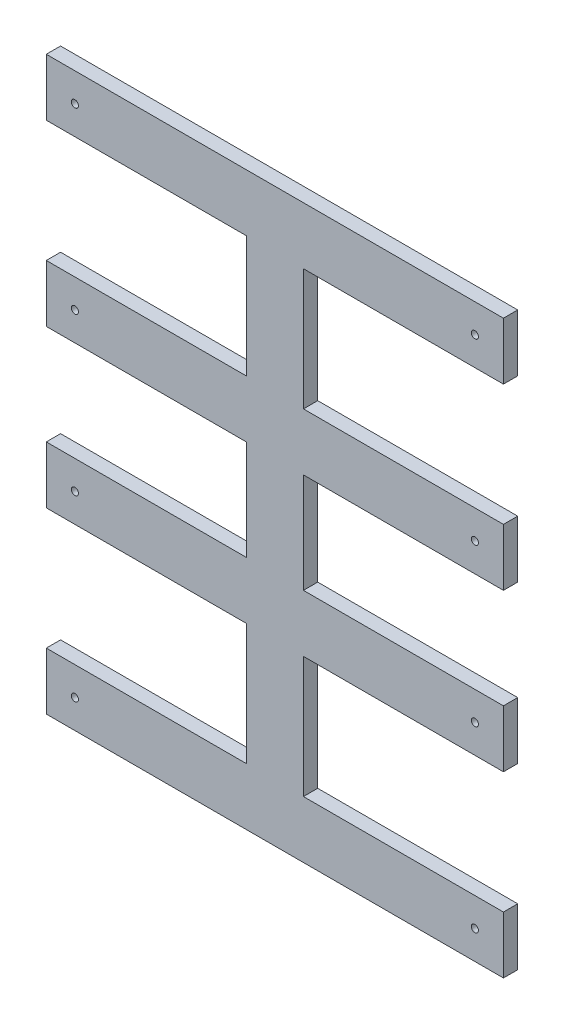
ISO-10303-21;
HEADER;
FILE_DESCRIPTION(('STEP AP214'),'2;1');
FILE_NAME('part.step','',(''),(''),'','','');
FILE_SCHEMA(('AUTOMOTIVE_DESIGN { 1 0 10303 214 1 1 1 1 }'));
ENDSEC;
DATA;
#1=APPLICATION_CONTEXT('core data for automotive mechanical design processes');
#2=APPLICATION_PROTOCOL_DEFINITION('international standard','automotive_design',2000,#1);
#3=PRODUCT_CONTEXT('',#1,'mechanical');
#4=PRODUCT('Part','Part','',(#3));
#5=PRODUCT_RELATED_PRODUCT_CATEGORY('part','',(#4));
#6=PRODUCT_DEFINITION_FORMATION('','',#4);
#7=PRODUCT_DEFINITION_CONTEXT('part definition',#1,'design');
#8=PRODUCT_DEFINITION('design','',#6,#7);
#9=PRODUCT_DEFINITION_SHAPE('','',#8);
#10=(LENGTH_UNIT() NAMED_UNIT(*) SI_UNIT(.MILLI.,.METRE.));
#11=(NAMED_UNIT(*) PLANE_ANGLE_UNIT() SI_UNIT($,.RADIAN.));
#12=(NAMED_UNIT(*) SI_UNIT($,.STERADIAN.) SOLID_ANGLE_UNIT());
#13=UNCERTAINTY_MEASURE_WITH_UNIT(LENGTH_MEASURE(1.E-05),#10,'distance_accuracy_value','');
#14=(GEOMETRIC_REPRESENTATION_CONTEXT(3) GLOBAL_UNCERTAINTY_ASSIGNED_CONTEXT((#13)) GLOBAL_UNIT_ASSIGNED_CONTEXT((#10,
#11,#12)) REPRESENTATION_CONTEXT('',''));
#15=CARTESIAN_POINT('',(0.,0.,0.));
#16=DIRECTION('',(0.,0.,1.));
#17=DIRECTION('',(1.,0.,0.));
#18=AXIS2_PLACEMENT_3D('',#15,#16,#17);
#19=CARTESIAN_POINT('',(0.,0.,6.35));
#20=DIRECTION('',(0.,0.,1.));
#21=DIRECTION('',(1.,0.,0.));
#22=AXIS2_PLACEMENT_3D('',#19,#20,#21);
#23=PLANE('',#22);
#24=CARTESIAN_POINT('',(88.9,-114.3,6.35));
#25=DIRECTION('',(0.,0.,1.));
#26=DIRECTION('',(-1.,0.,0.));
#27=AXIS2_PLACEMENT_3D('',#24,#25,#26);
#28=CIRCLE('',#27,1.5875);
#29=CARTESIAN_POINT('',(87.3125,-114.3,6.35));
#30=VERTEX_POINT('',#29);
#31=EDGE_CURVE('E516',#30,#30,#28,.T.);
#32=ORIENTED_EDGE('',*,*,#31,.F.);
#33=EDGE_LOOP('',(#32));
#34=FACE_BOUND('',#33,.T.);
#35=CARTESIAN_POINT('',(-88.9,-34.925,6.35));
#36=DIRECTION('',(0.,0.,1.));
#37=DIRECTION('',(-1.,0.,0.));
#38=AXIS2_PLACEMENT_3D('',#35,#36,#37);
#39=CIRCLE('',#38,1.5875);
#40=CARTESIAN_POINT('',(-90.4875,-34.925,6.35));
#41=VERTEX_POINT('',#40);
#42=EDGE_CURVE('E528',#41,#41,#39,.T.);
#43=ORIENTED_EDGE('',*,*,#42,.F.);
#44=EDGE_LOOP('',(#43));
#45=FACE_BOUND('',#44,.T.);
#46=CARTESIAN_POINT('',(88.9,34.925,6.35));
#47=DIRECTION('',(0.,0.,1.));
#48=DIRECTION('',(1.,0.,0.));
#49=AXIS2_PLACEMENT_3D('',#46,#47,#48);
#50=CIRCLE('',#49,1.5875);
#51=CARTESIAN_POINT('',(90.4875,34.925,6.35));
#52=VERTEX_POINT('',#51);
#53=EDGE_CURVE('E540',#52,#52,#50,.T.);
#54=ORIENTED_EDGE('',*,*,#53,.F.);
#55=EDGE_LOOP('',(#54));
#56=FACE_BOUND('',#55,.T.);
#57=CARTESIAN_POINT('',(-88.9,114.3,6.35));
#58=DIRECTION('',(0.,0.,1.));
#59=DIRECTION('',(1.,0.,0.));
#60=AXIS2_PLACEMENT_3D('',#57,#58,#59);
#61=CIRCLE('',#60,1.5875);
#62=CARTESIAN_POINT('',(-87.3125,114.3,6.35));
#63=VERTEX_POINT('',#62);
#64=EDGE_CURVE('E255',#63,#63,#61,.T.);
#65=ORIENTED_EDGE('',*,*,#64,.F.);
#66=EDGE_LOOP('',(#65));
#67=FACE_BOUND('',#66,.T.);
#68=DIRECTION('',(0.,1.,0.));
#69=VECTOR('',#68,1.);
#70=CARTESIAN_POINT('',(12.7,47.6249999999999,6.35));
#71=LINE('',#70,#69);
#72=CARTESIAN_POINT('',(12.7,47.6249999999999,6.35));
#73=VERTEX_POINT('',#72);
#74=CARTESIAN_POINT('',(12.7,101.6,6.35));
#75=VERTEX_POINT('',#74);
#76=EDGE_CURVE('E306',#73,#75,#71,.T.);
#77=ORIENTED_EDGE('',*,*,#76,.T.);
#78=DIRECTION('',(1.,0.,0.));
#79=VECTOR('',#78,1.);
#80=CARTESIAN_POINT('',(101.6,101.6,6.35));
#81=LINE('',#80,#79);
#82=CARTESIAN_POINT('',(101.6,101.6,6.35));
#83=VERTEX_POINT('',#82);
#84=EDGE_CURVE('E154',#75,#83,#81,.T.);
#85=ORIENTED_EDGE('',*,*,#84,.T.);
#86=DIRECTION('',(0.,1.,0.));
#87=VECTOR('',#86,1.);
#88=CARTESIAN_POINT('',(101.6,101.6,6.35));
#89=LINE('',#88,#87);
#90=CARTESIAN_POINT('',(101.6,127.,6.35));
#91=VERTEX_POINT('',#90);
#92=EDGE_CURVE('E381',#83,#91,#89,.T.);
#93=ORIENTED_EDGE('',*,*,#92,.T.);
#94=DIRECTION('',(-1.,0.,0.));
#95=VECTOR('',#94,1.);
#96=CARTESIAN_POINT('',(101.6,127.,6.35));
#97=LINE('',#96,#95);
#98=CARTESIAN_POINT('',(-101.6,127.,6.35));
#99=VERTEX_POINT('',#98);
#100=EDGE_CURVE('E400',#91,#99,#97,.T.);
#101=ORIENTED_EDGE('',*,*,#100,.T.);
#102=DIRECTION('',(0.,-1.,0.));
#103=VECTOR('',#102,1.);
#104=CARTESIAN_POINT('',(-101.6,101.6,6.35));
#105=LINE('',#104,#103);
#106=CARTESIAN_POINT('',(-101.6,101.6,6.35));
#107=VERTEX_POINT('',#106);
#108=EDGE_CURVE('E397',#99,#107,#105,.T.);
#109=ORIENTED_EDGE('',*,*,#108,.T.);
#110=DIRECTION('',(1.,0.,0.));
#111=VECTOR('',#110,1.);
#112=CARTESIAN_POINT('',(-12.7,101.6,6.35));
#113=LINE('',#112,#111);
#114=CARTESIAN_POINT('',(-12.7,101.6,6.35));
#115=VERTEX_POINT('',#114);
#116=EDGE_CURVE('E399',#107,#115,#113,.T.);
#117=ORIENTED_EDGE('',*,*,#116,.T.);
#118=DIRECTION('',(0.,-1.,0.));
#119=VECTOR('',#118,1.);
#120=CARTESIAN_POINT('',(-12.7,47.6249999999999,6.35));
#121=LINE('',#120,#119);
#122=CARTESIAN_POINT('',(-12.7,47.6249999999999,6.35));
#123=VERTEX_POINT('',#122);
#124=EDGE_CURVE('E402',#115,#123,#121,.T.);
#125=ORIENTED_EDGE('',*,*,#124,.T.);
#126=DIRECTION('',(-1.,0.,0.));
#127=VECTOR('',#126,1.);
#128=CARTESIAN_POINT('',(-12.7,47.6249999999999,6.35));
#129=LINE('',#128,#127);
#130=CARTESIAN_POINT('',(-101.6,47.625,6.35));
#131=VERTEX_POINT('',#130);
#132=EDGE_CURVE('E408',#123,#131,#129,.T.);
#133=ORIENTED_EDGE('',*,*,#132,.T.);
#134=DIRECTION('',(0.,-1.,0.));
#135=VECTOR('',#134,1.);
#136=CARTESIAN_POINT('',(-101.6,22.225,6.35));
#137=LINE('',#136,#135);
#138=CARTESIAN_POINT('',(-101.6,22.225,6.35));
#139=VERTEX_POINT('',#138);
#140=EDGE_CURVE('E410',#131,#139,#137,.T.);
#141=ORIENTED_EDGE('',*,*,#140,.T.);
#142=DIRECTION('',(1.,0.,0.));
#143=VECTOR('',#142,1.);
#144=CARTESIAN_POINT('',(-12.7,22.225,6.35));
#145=LINE('',#144,#143);
#146=CARTESIAN_POINT('',(-12.7,22.225,6.35));
#147=VERTEX_POINT('',#146);
#148=EDGE_CURVE('E412',#139,#147,#145,.T.);
#149=ORIENTED_EDGE('',*,*,#148,.T.);
#150=DIRECTION('',(0.,-1.,0.));
#151=VECTOR('',#150,1.);
#152=CARTESIAN_POINT('',(-12.7,-22.225,6.35));
#153=LINE('',#152,#151);
#154=CARTESIAN_POINT('',(-12.7,-22.225,6.35));
#155=VERTEX_POINT('',#154);
#156=EDGE_CURVE('E414',#147,#155,#153,.T.);
#157=ORIENTED_EDGE('',*,*,#156,.T.);
#158=DIRECTION('',(-1.,0.,0.));
#159=VECTOR('',#158,1.);
#160=CARTESIAN_POINT('',(-12.7,-22.225,6.35));
#161=LINE('',#160,#159);
#162=CARTESIAN_POINT('',(-101.6,-22.225,6.35));
#163=VERTEX_POINT('',#162);
#164=EDGE_CURVE('E416',#155,#163,#161,.T.);
#165=ORIENTED_EDGE('',*,*,#164,.T.);
#166=DIRECTION('',(0.,-1.,0.));
#167=VECTOR('',#166,1.);
#168=CARTESIAN_POINT('',(-101.6,-22.225,6.35));
#169=LINE('',#168,#167);
#170=CARTESIAN_POINT('',(-101.6,-47.625,6.35));
#171=VERTEX_POINT('',#170);
#172=EDGE_CURVE('E418',#163,#171,#169,.T.);
#173=ORIENTED_EDGE('',*,*,#172,.T.);
#174=DIRECTION('',(1.,0.,0.));
#175=VECTOR('',#174,1.);
#176=CARTESIAN_POINT('',(-12.7,-47.6249999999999,6.35));
#177=LINE('',#176,#175);
#178=CARTESIAN_POINT('',(-12.7,-47.6249999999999,6.35));
#179=VERTEX_POINT('',#178);
#180=EDGE_CURVE('E420',#171,#179,#177,.T.);
#181=ORIENTED_EDGE('',*,*,#180,.T.);
#182=DIRECTION('',(0.,-1.,0.));
#183=VECTOR('',#182,1.);
#184=CARTESIAN_POINT('',(-12.7,-47.6249999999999,6.35));
#185=LINE('',#184,#183);
#186=CARTESIAN_POINT('',(-12.7,-101.6,6.35));
#187=VERTEX_POINT('',#186);
#188=EDGE_CURVE('E422',#179,#187,#185,.T.);
#189=ORIENTED_EDGE('',*,*,#188,.T.);
#190=DIRECTION('',(-1.,0.,0.));
#191=VECTOR('',#190,1.);
#192=CARTESIAN_POINT('',(-12.7,-101.6,6.35));
#193=LINE('',#192,#191);
#194=CARTESIAN_POINT('',(-101.6,-101.6,6.35));
#195=VERTEX_POINT('',#194);
#196=EDGE_CURVE('E424',#187,#195,#193,.T.);
#197=ORIENTED_EDGE('',*,*,#196,.T.);
#198=DIRECTION('',(0.,-1.,0.));
#199=VECTOR('',#198,1.);
#200=CARTESIAN_POINT('',(-101.6,-101.6,6.35));
#201=LINE('',#200,#199);
#202=CARTESIAN_POINT('',(-101.6,-127.,6.35));
#203=VERTEX_POINT('',#202);
#204=EDGE_CURVE('E426',#195,#203,#201,.T.);
#205=ORIENTED_EDGE('',*,*,#204,.T.);
#206=DIRECTION('',(1.,0.,0.));
#207=VECTOR('',#206,1.);
#208=CARTESIAN_POINT('',(101.6,-127.,6.35));
#209=LINE('',#208,#207);
#210=CARTESIAN_POINT('',(101.6,-127.,6.35));
#211=VERTEX_POINT('',#210);
#212=EDGE_CURVE('E428',#203,#211,#209,.T.);
#213=ORIENTED_EDGE('',*,*,#212,.T.);
#214=DIRECTION('',(0.,1.,0.));
#215=VECTOR('',#214,1.);
#216=CARTESIAN_POINT('',(101.6,-101.6,6.35));
#217=LINE('',#216,#215);
#218=CARTESIAN_POINT('',(101.6,-101.6,6.35));
#219=VERTEX_POINT('',#218);
#220=EDGE_CURVE('E430',#211,#219,#217,.T.);
#221=ORIENTED_EDGE('',*,*,#220,.T.);
#222=DIRECTION('',(-1.,0.,0.));
#223=VECTOR('',#222,1.);
#224=CARTESIAN_POINT('',(101.6,-101.6,6.35));
#225=LINE('',#224,#223);
#226=CARTESIAN_POINT('',(12.7,-101.6,6.35));
#227=VERTEX_POINT('',#226);
#228=EDGE_CURVE('E432',#219,#227,#225,.T.);
#229=ORIENTED_EDGE('',*,*,#228,.T.);
#230=DIRECTION('',(0.,1.,0.));
#231=VECTOR('',#230,1.);
#232=CARTESIAN_POINT('',(12.7,-47.6249999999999,6.35));
#233=LINE('',#232,#231);
#234=CARTESIAN_POINT('',(12.7,-47.6249999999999,6.35));
#235=VERTEX_POINT('',#234);
#236=EDGE_CURVE('E434',#227,#235,#233,.T.);
#237=ORIENTED_EDGE('',*,*,#236,.T.);
#238=DIRECTION('',(1.,0.,0.));
#239=VECTOR('',#238,1.);
#240=CARTESIAN_POINT('',(101.6,-47.6249999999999,6.35));
#241=LINE('',#240,#239);
#242=CARTESIAN_POINT('',(101.6,-47.6249999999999,6.35));
#243=VERTEX_POINT('',#242);
#244=EDGE_CURVE('E436',#235,#243,#241,.T.);
#245=ORIENTED_EDGE('',*,*,#244,.T.);
#246=DIRECTION('',(0.,1.,0.));
#247=VECTOR('',#246,1.);
#248=CARTESIAN_POINT('',(101.6,-22.2250000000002,6.35));
#249=LINE('',#248,#247);
#250=CARTESIAN_POINT('',(101.6,-22.2250000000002,6.35));
#251=VERTEX_POINT('',#250);
#252=EDGE_CURVE('E438',#243,#251,#249,.T.);
#253=ORIENTED_EDGE('',*,*,#252,.T.);
#254=DIRECTION('',(-1.,0.,0.));
#255=VECTOR('',#254,1.);
#256=CARTESIAN_POINT('',(101.6,-22.2250000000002,6.35));
#257=LINE('',#256,#255);
#258=CARTESIAN_POINT('',(12.7,-22.225,6.35));
#259=VERTEX_POINT('',#258);
#260=EDGE_CURVE('E440',#251,#259,#257,.T.);
#261=ORIENTED_EDGE('',*,*,#260,.T.);
#262=DIRECTION('',(0.,1.,0.));
#263=VECTOR('',#262,1.);
#264=CARTESIAN_POINT('',(12.7,-22.225,6.35));
#265=LINE('',#264,#263);
#266=CARTESIAN_POINT('',(12.7,22.225,6.35));
#267=VERTEX_POINT('',#266);
#268=EDGE_CURVE('E233',#259,#267,#265,.T.);
#269=ORIENTED_EDGE('',*,*,#268,.T.);
#270=DIRECTION('',(1.,0.,0.));
#271=VECTOR('',#270,1.);
#272=CARTESIAN_POINT('',(101.6,22.2250000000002,6.35));
#273=LINE('',#272,#271);
#274=CARTESIAN_POINT('',(101.6,22.2250000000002,6.35));
#275=VERTEX_POINT('',#274);
#276=EDGE_CURVE('E227',#267,#275,#273,.T.);
#277=ORIENTED_EDGE('',*,*,#276,.T.);
#278=DIRECTION('',(0.,1.,0.));
#279=VECTOR('',#278,1.);
#280=CARTESIAN_POINT('',(101.6,22.2250000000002,6.35));
#281=LINE('',#280,#279);
#282=CARTESIAN_POINT('',(101.6,47.6249999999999,6.35));
#283=VERTEX_POINT('',#282);
#284=EDGE_CURVE('E231',#275,#283,#281,.T.);
#285=ORIENTED_EDGE('',*,*,#284,.T.);
#286=DIRECTION('',(-1.,0.,0.));
#287=VECTOR('',#286,1.);
#288=CARTESIAN_POINT('',(101.6,47.6249999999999,6.35));
#289=LINE('',#288,#287);
#290=EDGE_CURVE('E51',#283,#73,#289,.T.);
#291=ORIENTED_EDGE('',*,*,#290,.T.);
#292=EDGE_LOOP('',(#77,#85,#93,#101,#109,#117,#125,#133,#141,#149,#157,#165,#173,#181,#189,#197,
#205,#213,#221,#229,#237,#245,#253,#261,#269,#277,#285,#291));
#293=FACE_BOUND('',#292,.T.);
#294=CARTESIAN_POINT('',(88.9,114.3,6.35));
#295=DIRECTION('',(0.,0.,1.));
#296=DIRECTION('',(1.,0.,0.));
#297=AXIS2_PLACEMENT_3D('',#294,#295,#296);
#298=CIRCLE('',#297,1.5875);
#299=CARTESIAN_POINT('',(90.4875,114.3,6.35));
#300=VERTEX_POINT('',#299);
#301=EDGE_CURVE('E546',#300,#300,#298,.T.);
#302=ORIENTED_EDGE('',*,*,#301,.F.);
#303=EDGE_LOOP('',(#302));
#304=FACE_BOUND('',#303,.T.);
#305=CARTESIAN_POINT('',(-88.9,34.925,6.35));
#306=DIRECTION('',(0.,0.,1.));
#307=DIRECTION('',(1.,0.,0.));
#308=AXIS2_PLACEMENT_3D('',#305,#306,#307);
#309=CIRCLE('',#308,1.5875);
#310=CARTESIAN_POINT('',(-87.3125,34.925,6.35));
#311=VERTEX_POINT('',#310);
#312=EDGE_CURVE('E534',#311,#311,#309,.T.);
#313=ORIENTED_EDGE('',*,*,#312,.F.);
#314=EDGE_LOOP('',(#313));
#315=FACE_BOUND('',#314,.T.);
#316=CARTESIAN_POINT('',(88.9,-34.925,6.35));
#317=DIRECTION('',(0.,0.,1.));
#318=DIRECTION('',(-1.,0.,0.));
#319=AXIS2_PLACEMENT_3D('',#316,#317,#318);
#320=CIRCLE('',#319,1.5875);
#321=CARTESIAN_POINT('',(87.3125,-34.925,6.35));
#322=VERTEX_POINT('',#321);
#323=EDGE_CURVE('E522',#322,#322,#320,.T.);
#324=ORIENTED_EDGE('',*,*,#323,.F.);
#325=EDGE_LOOP('',(#324));
#326=FACE_BOUND('',#325,.T.);
#327=CARTESIAN_POINT('',(-88.9,-114.3,6.35));
#328=DIRECTION('',(0.,0.,1.));
#329=DIRECTION('',(-1.,0.,0.));
#330=AXIS2_PLACEMENT_3D('',#327,#328,#329);
#331=CIRCLE('',#330,1.5875);
#332=CARTESIAN_POINT('',(-90.4875,-114.3,6.35));
#333=VERTEX_POINT('',#332);
#334=EDGE_CURVE('E507',#333,#333,#331,.T.);
#335=ORIENTED_EDGE('',*,*,#334,.F.);
#336=EDGE_LOOP('',(#335));
#337=FACE_BOUND('',#336,.T.);
#338=ADVANCED_FACE('F34',(#34,#45,#56,#67,#293,#304,#315,#326,#337),#23,.T.);
#339=CARTESIAN_POINT('',(0.,0.,0.));
#340=DIRECTION('',(0.,0.,1.));
#341=DIRECTION('',(1.,0.,0.));
#342=AXIS2_PLACEMENT_3D('',#339,#340,#341);
#343=PLANE('',#342);
#344=DIRECTION('',(0.,1.,0.));
#345=VECTOR('',#344,1.);
#346=CARTESIAN_POINT('',(12.7,47.6249999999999,0.));
#347=LINE('',#346,#345);
#348=CARTESIAN_POINT('',(12.7,47.6249999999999,0.));
#349=VERTEX_POINT('',#348);
#350=CARTESIAN_POINT('',(12.7,101.6,0.));
#351=VERTEX_POINT('',#350);
#352=EDGE_CURVE('E251',#349,#351,#347,.T.);
#353=ORIENTED_EDGE('',*,*,#352,.F.);
#354=DIRECTION('',(-1.,0.,0.));
#355=VECTOR('',#354,1.);
#356=CARTESIAN_POINT('',(101.6,47.6249999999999,0.));
#357=LINE('',#356,#355);
#358=CARTESIAN_POINT('',(101.6,47.6249999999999,0.));
#359=VERTEX_POINT('',#358);
#360=EDGE_CURVE('E146',#359,#349,#357,.T.);
#361=ORIENTED_EDGE('',*,*,#360,.F.);
#362=DIRECTION('',(0.,1.,0.));
#363=VECTOR('',#362,1.);
#364=CARTESIAN_POINT('',(101.6,22.2250000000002,0.));
#365=LINE('',#364,#363);
#366=CARTESIAN_POINT('',(101.6,22.2250000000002,0.));
#367=VERTEX_POINT('',#366);
#368=EDGE_CURVE('E140',#367,#359,#365,.T.);
#369=ORIENTED_EDGE('',*,*,#368,.F.);
#370=DIRECTION('',(1.,0.,0.));
#371=VECTOR('',#370,1.);
#372=CARTESIAN_POINT('',(101.6,22.2250000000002,0.));
#373=LINE('',#372,#371);
#374=CARTESIAN_POINT('',(12.7,22.225,0.));
#375=VERTEX_POINT('',#374);
#376=EDGE_CURVE('E241',#375,#367,#373,.T.);
#377=ORIENTED_EDGE('',*,*,#376,.F.);
#378=DIRECTION('',(0.,1.,0.));
#379=VECTOR('',#378,1.);
#380=CARTESIAN_POINT('',(12.7,-22.225,0.));
#381=LINE('',#380,#379);
#382=CARTESIAN_POINT('',(12.7,-22.225,0.));
#383=VERTEX_POINT('',#382);
#384=EDGE_CURVE('E301',#383,#375,#381,.T.);
#385=ORIENTED_EDGE('',*,*,#384,.F.);
#386=DIRECTION('',(-1.,0.,0.));
#387=VECTOR('',#386,1.);
#388=CARTESIAN_POINT('',(101.6,-22.2250000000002,0.));
#389=LINE('',#388,#387);
#390=CARTESIAN_POINT('',(101.6,-22.2250000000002,0.));
#391=VERTEX_POINT('',#390);
#392=EDGE_CURVE('E299',#391,#383,#389,.T.);
#393=ORIENTED_EDGE('',*,*,#392,.F.);
#394=DIRECTION('',(0.,1.,0.));
#395=VECTOR('',#394,1.);
#396=CARTESIAN_POINT('',(101.6,-22.2250000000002,0.));
#397=LINE('',#396,#395);
#398=CARTESIAN_POINT('',(101.6,-47.6249999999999,0.));
#399=VERTEX_POINT('',#398);
#400=EDGE_CURVE('E297',#399,#391,#397,.T.);
#401=ORIENTED_EDGE('',*,*,#400,.F.);
#402=DIRECTION('',(1.,0.,0.));
#403=VECTOR('',#402,1.);
#404=CARTESIAN_POINT('',(101.6,-47.6249999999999,0.));
#405=LINE('',#404,#403);
#406=CARTESIAN_POINT('',(12.7,-47.6249999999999,0.));
#407=VERTEX_POINT('',#406);
#408=EDGE_CURVE('E295',#407,#399,#405,.T.);
#409=ORIENTED_EDGE('',*,*,#408,.F.);
#410=DIRECTION('',(0.,1.,0.));
#411=VECTOR('',#410,1.);
#412=CARTESIAN_POINT('',(12.7,-47.6249999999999,0.));
#413=LINE('',#412,#411);
#414=CARTESIAN_POINT('',(12.7,-101.6,0.));
#415=VERTEX_POINT('',#414);
#416=EDGE_CURVE('E293',#415,#407,#413,.T.);
#417=ORIENTED_EDGE('',*,*,#416,.F.);
#418=DIRECTION('',(-1.,0.,0.));
#419=VECTOR('',#418,1.);
#420=CARTESIAN_POINT('',(101.6,-101.6,0.));
#421=LINE('',#420,#419);
#422=CARTESIAN_POINT('',(101.6,-101.6,0.));
#423=VERTEX_POINT('',#422);
#424=EDGE_CURVE('E291',#423,#415,#421,.T.);
#425=ORIENTED_EDGE('',*,*,#424,.F.);
#426=DIRECTION('',(0.,1.,0.));
#427=VECTOR('',#426,1.);
#428=CARTESIAN_POINT('',(101.6,-101.6,0.));
#429=LINE('',#428,#427);
#430=CARTESIAN_POINT('',(101.6,-127.,0.));
#431=VERTEX_POINT('',#430);
#432=EDGE_CURVE('E289',#431,#423,#429,.T.);
#433=ORIENTED_EDGE('',*,*,#432,.F.);
#434=DIRECTION('',(1.,0.,0.));
#435=VECTOR('',#434,1.);
#436=CARTESIAN_POINT('',(101.6,-127.,0.));
#437=LINE('',#436,#435);
#438=CARTESIAN_POINT('',(-101.6,-127.,0.));
#439=VERTEX_POINT('',#438);
#440=EDGE_CURVE('E287',#439,#431,#437,.T.);
#441=ORIENTED_EDGE('',*,*,#440,.F.);
#442=DIRECTION('',(0.,-1.,0.));
#443=VECTOR('',#442,1.);
#444=CARTESIAN_POINT('',(-101.6,-101.6,0.));
#445=LINE('',#444,#443);
#446=CARTESIAN_POINT('',(-101.6,-101.6,0.));
#447=VERTEX_POINT('',#446);
#448=EDGE_CURVE('E285',#447,#439,#445,.T.);
#449=ORIENTED_EDGE('',*,*,#448,.F.);
#450=DIRECTION('',(-1.,0.,0.));
#451=VECTOR('',#450,1.);
#452=CARTESIAN_POINT('',(-12.7,-101.6,0.));
#453=LINE('',#452,#451);
#454=CARTESIAN_POINT('',(-12.7,-101.6,0.));
#455=VERTEX_POINT('',#454);
#456=EDGE_CURVE('E283',#455,#447,#453,.T.);
#457=ORIENTED_EDGE('',*,*,#456,.F.);
#458=DIRECTION('',(0.,-1.,0.));
#459=VECTOR('',#458,1.);
#460=CARTESIAN_POINT('',(-12.7,-47.6249999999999,0.));
#461=LINE('',#460,#459);
#462=CARTESIAN_POINT('',(-12.7,-47.6249999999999,0.));
#463=VERTEX_POINT('',#462);
#464=EDGE_CURVE('E281',#463,#455,#461,.T.);
#465=ORIENTED_EDGE('',*,*,#464,.F.);
#466=DIRECTION('',(1.,0.,0.));
#467=VECTOR('',#466,1.);
#468=CARTESIAN_POINT('',(-12.7,-47.6249999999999,0.));
#469=LINE('',#468,#467);
#470=CARTESIAN_POINT('',(-101.6,-47.625,0.));
#471=VERTEX_POINT('',#470);
#472=EDGE_CURVE('E279',#471,#463,#469,.T.);
#473=ORIENTED_EDGE('',*,*,#472,.F.);
#474=DIRECTION('',(0.,-1.,0.));
#475=VECTOR('',#474,1.);
#476=CARTESIAN_POINT('',(-101.6,-22.225,0.));
#477=LINE('',#476,#475);
#478=CARTESIAN_POINT('',(-101.6,-22.225,0.));
#479=VERTEX_POINT('',#478);
#480=EDGE_CURVE('E277',#479,#471,#477,.T.);
#481=ORIENTED_EDGE('',*,*,#480,.F.);
#482=DIRECTION('',(-1.,0.,0.));
#483=VECTOR('',#482,1.);
#484=CARTESIAN_POINT('',(-12.7,-22.225,0.));
#485=LINE('',#484,#483);
#486=CARTESIAN_POINT('',(-12.7,-22.225,0.));
#487=VERTEX_POINT('',#486);
#488=EDGE_CURVE('E275',#487,#479,#485,.T.);
#489=ORIENTED_EDGE('',*,*,#488,.F.);
#490=DIRECTION('',(0.,-1.,0.));
#491=VECTOR('',#490,1.);
#492=CARTESIAN_POINT('',(-12.7,-22.225,0.));
#493=LINE('',#492,#491);
#494=CARTESIAN_POINT('',(-12.7,22.225,0.));
#495=VERTEX_POINT('',#494);
#496=EDGE_CURVE('E273',#495,#487,#493,.T.);
#497=ORIENTED_EDGE('',*,*,#496,.F.);
#498=DIRECTION('',(1.,0.,0.));
#499=VECTOR('',#498,1.);
#500=CARTESIAN_POINT('',(-12.7,22.225,0.));
#501=LINE('',#500,#499);
#502=CARTESIAN_POINT('',(-101.6,22.225,0.));
#503=VERTEX_POINT('',#502);
#504=EDGE_CURVE('E271',#503,#495,#501,.T.);
#505=ORIENTED_EDGE('',*,*,#504,.F.);
#506=DIRECTION('',(0.,-1.,0.));
#507=VECTOR('',#506,1.);
#508=CARTESIAN_POINT('',(-101.6,22.225,0.));
#509=LINE('',#508,#507);
#510=CARTESIAN_POINT('',(-101.6,47.625,0.));
#511=VERTEX_POINT('',#510);
#512=EDGE_CURVE('E269',#511,#503,#509,.T.);
#513=ORIENTED_EDGE('',*,*,#512,.F.);
#514=DIRECTION('',(-1.,0.,0.));
#515=VECTOR('',#514,1.);
#516=CARTESIAN_POINT('',(-12.7,47.6249999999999,0.));
#517=LINE('',#516,#515);
#518=CARTESIAN_POINT('',(-12.7,47.6249999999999,0.));
#519=VERTEX_POINT('',#518);
#520=EDGE_CURVE('E267',#519,#511,#517,.T.);
#521=ORIENTED_EDGE('',*,*,#520,.F.);
#522=DIRECTION('',(0.,-1.,0.));
#523=VECTOR('',#522,1.);
#524=CARTESIAN_POINT('',(-12.7,47.6249999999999,0.));
#525=LINE('',#524,#523);
#526=CARTESIAN_POINT('',(-12.7,101.6,0.));
#527=VERTEX_POINT('',#526);
#528=EDGE_CURVE('E265',#527,#519,#525,.T.);
#529=ORIENTED_EDGE('',*,*,#528,.F.);
#530=DIRECTION('',(1.,0.,0.));
#531=VECTOR('',#530,1.);
#532=CARTESIAN_POINT('',(-12.7,101.6,0.));
#533=LINE('',#532,#531);
#534=CARTESIAN_POINT('',(-101.6,101.6,0.));
#535=VERTEX_POINT('',#534);
#536=EDGE_CURVE('E263',#535,#527,#533,.T.);
#537=ORIENTED_EDGE('',*,*,#536,.F.);
#538=DIRECTION('',(0.,-1.,0.));
#539=VECTOR('',#538,1.);
#540=CARTESIAN_POINT('',(-101.6,101.6,0.));
#541=LINE('',#540,#539);
#542=CARTESIAN_POINT('',(-101.6,127.,0.));
#543=VERTEX_POINT('',#542);
#544=EDGE_CURVE('E261',#543,#535,#541,.T.);
#545=ORIENTED_EDGE('',*,*,#544,.F.);
#546=DIRECTION('',(-1.,0.,0.));
#547=VECTOR('',#546,1.);
#548=CARTESIAN_POINT('',(101.6,127.,0.));
#549=LINE('',#548,#547);
#550=CARTESIAN_POINT('',(101.6,127.,0.));
#551=VERTEX_POINT('',#550);
#552=EDGE_CURVE('E259',#551,#543,#549,.T.);
#553=ORIENTED_EDGE('',*,*,#552,.F.);
#554=DIRECTION('',(0.,1.,0.));
#555=VECTOR('',#554,1.);
#556=CARTESIAN_POINT('',(101.6,101.6,0.));
#557=LINE('',#556,#555);
#558=CARTESIAN_POINT('',(101.6,101.6,0.));
#559=VERTEX_POINT('',#558);
#560=EDGE_CURVE('E257',#559,#551,#557,.T.);
#561=ORIENTED_EDGE('',*,*,#560,.F.);
#562=DIRECTION('',(1.,0.,0.));
#563=VECTOR('',#562,1.);
#564=CARTESIAN_POINT('',(101.6,101.6,0.));
#565=LINE('',#564,#563);
#566=EDGE_CURVE('E254',#351,#559,#565,.T.);
#567=ORIENTED_EDGE('',*,*,#566,.F.);
#568=EDGE_LOOP('',(#353,#361,#369,#377,#385,#393,#401,#409,#417,#425,#433,#441,#449,#457,#465,
#473,#481,#489,#497,#505,#513,#521,#529,#537,#545,#553,#561,#567));
#569=FACE_BOUND('',#568,.T.);
#570=CARTESIAN_POINT('',(-88.9,114.3,0.));
#571=DIRECTION('',(0.,0.,1.));
#572=DIRECTION('',(1.,0.,0.));
#573=AXIS2_PLACEMENT_3D('',#570,#571,#572);
#574=CIRCLE('',#573,1.5875);
#575=CARTESIAN_POINT('',(-87.3125,114.3,0.));
#576=VERTEX_POINT('',#575);
#577=EDGE_CURVE('E549',#576,#576,#574,.T.);
#578=ORIENTED_EDGE('',*,*,#577,.T.);
#579=EDGE_LOOP('',(#578));
#580=FACE_BOUND('',#579,.T.);
#581=CARTESIAN_POINT('',(88.9,114.3,0.));
#582=DIRECTION('',(0.,0.,1.));
#583=DIRECTION('',(1.,0.,0.));
#584=AXIS2_PLACEMENT_3D('',#581,#582,#583);
#585=CIRCLE('',#584,1.5875);
#586=CARTESIAN_POINT('',(90.4875,114.3,0.));
#587=VERTEX_POINT('',#586);
#588=EDGE_CURVE('E543',#587,#587,#585,.T.);
#589=ORIENTED_EDGE('',*,*,#588,.T.);
#590=EDGE_LOOP('',(#589));
#591=FACE_BOUND('',#590,.T.);
#592=CARTESIAN_POINT('',(88.9,34.925,0.));
#593=DIRECTION('',(0.,0.,1.));
#594=DIRECTION('',(1.,0.,0.));
#595=AXIS2_PLACEMENT_3D('',#592,#593,#594);
#596=CIRCLE('',#595,1.5875);
#597=CARTESIAN_POINT('',(90.4875,34.925,0.));
#598=VERTEX_POINT('',#597);
#599=EDGE_CURVE('E537',#598,#598,#596,.T.);
#600=ORIENTED_EDGE('',*,*,#599,.T.);
#601=EDGE_LOOP('',(#600));
#602=FACE_BOUND('',#601,.T.);
#603=CARTESIAN_POINT('',(-88.9,34.925,0.));
#604=DIRECTION('',(0.,0.,1.));
#605=DIRECTION('',(1.,0.,0.));
#606=AXIS2_PLACEMENT_3D('',#603,#604,#605);
#607=CIRCLE('',#606,1.5875);
#608=CARTESIAN_POINT('',(-87.3125,34.925,0.));
#609=VERTEX_POINT('',#608);
#610=EDGE_CURVE('E531',#609,#609,#607,.T.);
#611=ORIENTED_EDGE('',*,*,#610,.T.);
#612=EDGE_LOOP('',(#611));
#613=FACE_BOUND('',#612,.T.);
#614=CARTESIAN_POINT('',(-88.9,-34.925,0.));
#615=DIRECTION('',(0.,0.,1.));
#616=DIRECTION('',(-1.,0.,0.));
#617=AXIS2_PLACEMENT_3D('',#614,#615,#616);
#618=CIRCLE('',#617,1.5875);
#619=CARTESIAN_POINT('',(-90.4875,-34.925,0.));
#620=VERTEX_POINT('',#619);
#621=EDGE_CURVE('E525',#620,#620,#618,.T.);
#622=ORIENTED_EDGE('',*,*,#621,.T.);
#623=EDGE_LOOP('',(#622));
#624=FACE_BOUND('',#623,.T.);
#625=CARTESIAN_POINT('',(88.9,-34.925,0.));
#626=DIRECTION('',(0.,0.,1.));
#627=DIRECTION('',(-1.,0.,0.));
#628=AXIS2_PLACEMENT_3D('',#625,#626,#627);
#629=CIRCLE('',#628,1.5875);
#630=CARTESIAN_POINT('',(87.3125,-34.925,0.));
#631=VERTEX_POINT('',#630);
#632=EDGE_CURVE('E519',#631,#631,#629,.T.);
#633=ORIENTED_EDGE('',*,*,#632,.T.);
#634=EDGE_LOOP('',(#633));
#635=FACE_BOUND('',#634,.T.);
#636=CARTESIAN_POINT('',(88.9,-114.3,0.));
#637=DIRECTION('',(0.,0.,1.));
#638=DIRECTION('',(-1.,0.,0.));
#639=AXIS2_PLACEMENT_3D('',#636,#637,#638);
#640=CIRCLE('',#639,1.5875);
#641=CARTESIAN_POINT('',(87.3125,-114.3,0.));
#642=VERTEX_POINT('',#641);
#643=EDGE_CURVE('E513',#642,#642,#640,.T.);
#644=ORIENTED_EDGE('',*,*,#643,.T.);
#645=EDGE_LOOP('',(#644));
#646=FACE_BOUND('',#645,.T.);
#647=CARTESIAN_POINT('',(-88.9,-114.3,0.));
#648=DIRECTION('',(0.,0.,1.));
#649=DIRECTION('',(-1.,0.,0.));
#650=AXIS2_PLACEMENT_3D('',#647,#648,#649);
#651=CIRCLE('',#650,1.5875);
#652=CARTESIAN_POINT('',(-90.4875,-114.3,0.));
#653=VERTEX_POINT('',#652);
#654=EDGE_CURVE('E510',#653,#653,#651,.T.);
#655=ORIENTED_EDGE('',*,*,#654,.T.);
#656=EDGE_LOOP('',(#655));
#657=FACE_BOUND('',#656,.T.);
#658=ADVANCED_FACE('F385',(#569,#580,#591,#602,#613,#624,#635,#646,#657),#343,.F.);
#659=CARTESIAN_POINT('',(12.7,47.6249999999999,6.35));
#660=DIRECTION('',(-1.,0.,0.));
#661=DIRECTION('',(0.,-1.,0.));
#662=AXIS2_PLACEMENT_3D('',#659,#660,#661);
#663=PLANE('',#662);
#664=ORIENTED_EDGE('',*,*,#352,.T.);
#665=DIRECTION('',(0.,0.,-1.));
#666=VECTOR('',#665,1.);
#667=CARTESIAN_POINT('',(12.7,101.6,6.35));
#668=LINE('',#667,#666);
#669=EDGE_CURVE('E11',#75,#351,#668,.T.);
#670=ORIENTED_EDGE('',*,*,#669,.F.);
#671=ORIENTED_EDGE('',*,*,#76,.F.);
#672=DIRECTION('',(0.,0.,-1.));
#673=VECTOR('',#672,1.);
#674=CARTESIAN_POINT('',(12.7,47.6249999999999,6.35));
#675=LINE('',#674,#673);
#676=EDGE_CURVE('E247',#73,#349,#675,.T.);
#677=ORIENTED_EDGE('',*,*,#676,.T.);
#678=EDGE_LOOP('',(#664,#670,#671,#677));
#679=FACE_BOUND('',#678,.T.);
#680=ADVANCED_FACE('F36',(#679),#663,.F.);
#681=CARTESIAN_POINT('',(101.6,101.6,6.35));
#682=DIRECTION('',(0.,1.,0.));
#683=DIRECTION('',(-1.,0.,0.));
#684=AXIS2_PLACEMENT_3D('',#681,#682,#683);
#685=PLANE('',#684);
#686=ORIENTED_EDGE('',*,*,#566,.T.);
#687=DIRECTION('',(0.,0.,-1.));
#688=VECTOR('',#687,1.);
#689=CARTESIAN_POINT('',(101.6,101.6,6.35));
#690=LINE('',#689,#688);
#691=EDGE_CURVE('E43',#83,#559,#690,.T.);
#692=ORIENTED_EDGE('',*,*,#691,.F.);
#693=ORIENTED_EDGE('',*,*,#84,.F.);
#694=ORIENTED_EDGE('',*,*,#669,.T.);
#695=EDGE_LOOP('',(#686,#692,#693,#694));
#696=FACE_BOUND('',#695,.T.);
#697=ADVANCED_FACE('F855',(#696),#685,.F.);
#698=CARTESIAN_POINT('',(101.6,101.6,6.35));
#699=DIRECTION('',(-1.,0.,0.));
#700=DIRECTION('',(0.,0.,1.));
#701=AXIS2_PLACEMENT_3D('',#698,#699,#700);
#702=PLANE('',#701);
#703=ORIENTED_EDGE('',*,*,#560,.T.);
#704=DIRECTION('',(0.,0.,-1.));
#705=VECTOR('',#704,1.);
#706=CARTESIAN_POINT('',(101.6,127.,6.35));
#707=LINE('',#706,#705);
#708=EDGE_CURVE('E373',#91,#551,#707,.T.);
#709=ORIENTED_EDGE('',*,*,#708,.F.);
#710=ORIENTED_EDGE('',*,*,#92,.F.);
#711=ORIENTED_EDGE('',*,*,#691,.T.);
#712=EDGE_LOOP('',(#703,#709,#710,#711));
#713=FACE_BOUND('',#712,.T.);
#714=ADVANCED_FACE('F379',(#713),#702,.F.);
#715=CARTESIAN_POINT('',(101.6,127.,6.35));
#716=DIRECTION('',(0.,-1.,0.));
#717=DIRECTION('',(1.,0.,0.));
#718=AXIS2_PLACEMENT_3D('',#715,#716,#717);
#719=PLANE('',#718);
#720=ORIENTED_EDGE('',*,*,#552,.T.);
#721=DIRECTION('',(0.,0.,-1.));
#722=VECTOR('',#721,1.);
#723=CARTESIAN_POINT('',(-101.6,127.,6.35));
#724=LINE('',#723,#722);
#725=EDGE_CURVE('E370',#99,#543,#724,.T.);
#726=ORIENTED_EDGE('',*,*,#725,.F.);
#727=ORIENTED_EDGE('',*,*,#100,.F.);
#728=ORIENTED_EDGE('',*,*,#708,.T.);
#729=EDGE_LOOP('',(#720,#726,#727,#728));
#730=FACE_BOUND('',#729,.T.);
#731=ADVANCED_FACE('F391',(#730),#719,.F.);
#732=CARTESIAN_POINT('',(-101.6,101.6,6.35));
#733=DIRECTION('',(1.,0.,0.));
#734=DIRECTION('',(0.,0.,-1.));
#735=AXIS2_PLACEMENT_3D('',#732,#733,#734);
#736=PLANE('',#735);
#737=ORIENTED_EDGE('',*,*,#544,.T.);
#738=DIRECTION('',(0.,0.,-1.));
#739=VECTOR('',#738,1.);
#740=CARTESIAN_POINT('',(-101.6,101.6,6.35));
#741=LINE('',#740,#739);
#742=EDGE_CURVE('E367',#107,#535,#741,.T.);
#743=ORIENTED_EDGE('',*,*,#742,.F.);
#744=ORIENTED_EDGE('',*,*,#108,.F.);
#745=ORIENTED_EDGE('',*,*,#725,.T.);
#746=EDGE_LOOP('',(#737,#743,#744,#745));
#747=FACE_BOUND('',#746,.T.);
#748=ADVANCED_FACE('F395',(#747),#736,.F.);
#749=CARTESIAN_POINT('',(-12.7,101.6,6.35));
#750=DIRECTION('',(0.,1.,0.));
#751=DIRECTION('',(-1.,0.,0.));
#752=AXIS2_PLACEMENT_3D('',#749,#750,#751);
#753=PLANE('',#752);
#754=ORIENTED_EDGE('',*,*,#536,.T.);
#755=DIRECTION('',(0.,0.,-1.));
#756=VECTOR('',#755,1.);
#757=CARTESIAN_POINT('',(-12.7,101.6,6.35));
#758=LINE('',#757,#756);
#759=EDGE_CURVE('E364',#115,#527,#758,.T.);
#760=ORIENTED_EDGE('',*,*,#759,.F.);
#761=ORIENTED_EDGE('',*,*,#116,.F.);
#762=ORIENTED_EDGE('',*,*,#742,.T.);
#763=EDGE_LOOP('',(#754,#760,#761,#762));
#764=FACE_BOUND('',#763,.T.);
#765=ADVANCED_FACE('F820',(#764),#753,.F.);
#766=CARTESIAN_POINT('',(-12.7,47.6249999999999,6.35));
#767=DIRECTION('',(1.,0.,0.));
#768=DIRECTION('',(0.,1.,0.));
#769=AXIS2_PLACEMENT_3D('',#766,#767,#768);
#770=PLANE('',#769);
#771=ORIENTED_EDGE('',*,*,#528,.T.);
#772=DIRECTION('',(0.,0.,-1.));
#773=VECTOR('',#772,1.);
#774=CARTESIAN_POINT('',(-12.7,47.6249999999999,6.35));
#775=LINE('',#774,#773);
#776=EDGE_CURVE('E361',#123,#519,#775,.T.);
#777=ORIENTED_EDGE('',*,*,#776,.F.);
#778=ORIENTED_EDGE('',*,*,#124,.F.);
#779=ORIENTED_EDGE('',*,*,#759,.T.);
#780=EDGE_LOOP('',(#771,#777,#778,#779));
#781=FACE_BOUND('',#780,.T.);
#782=ADVANCED_FACE('F810',(#781),#770,.F.);
#783=CARTESIAN_POINT('',(-12.7,47.6249999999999,6.35));
#784=DIRECTION('',(0.,-1.,0.));
#785=DIRECTION('',(1.,0.,0.));
#786=AXIS2_PLACEMENT_3D('',#783,#784,#785);
#787=PLANE('',#786);
#788=ORIENTED_EDGE('',*,*,#520,.T.);
#789=DIRECTION('',(0.,0.,-1.));
#790=VECTOR('',#789,1.);
#791=CARTESIAN_POINT('',(-101.6,47.625,6.35));
#792=LINE('',#791,#790);
#793=EDGE_CURVE('E358',#131,#511,#792,.T.);
#794=ORIENTED_EDGE('',*,*,#793,.F.);
#795=ORIENTED_EDGE('',*,*,#132,.F.);
#796=ORIENTED_EDGE('',*,*,#776,.T.);
#797=EDGE_LOOP('',(#788,#794,#795,#796));
#798=FACE_BOUND('',#797,.T.);
#799=ADVANCED_FACE('F800',(#798),#787,.F.);
#800=CARTESIAN_POINT('',(-101.6,22.225,6.35));
#801=DIRECTION('',(1.,0.,0.));
#802=DIRECTION('',(0.,0.,-1.));
#803=AXIS2_PLACEMENT_3D('',#800,#801,#802);
#804=PLANE('',#803);
#805=ORIENTED_EDGE('',*,*,#512,.T.);
#806=DIRECTION('',(0.,0.,-1.));
#807=VECTOR('',#806,1.);
#808=CARTESIAN_POINT('',(-101.6,22.225,6.35));
#809=LINE('',#808,#807);
#810=EDGE_CURVE('E355',#139,#503,#809,.T.);
#811=ORIENTED_EDGE('',*,*,#810,.F.);
#812=ORIENTED_EDGE('',*,*,#140,.F.);
#813=ORIENTED_EDGE('',*,*,#793,.T.);
#814=EDGE_LOOP('',(#805,#811,#812,#813));
#815=FACE_BOUND('',#814,.T.);
#816=ADVANCED_FACE('F790',(#815),#804,.F.);
#817=CARTESIAN_POINT('',(-12.7,22.225,6.35));
#818=DIRECTION('',(0.,1.,0.));
#819=DIRECTION('',(-1.,0.,0.));
#820=AXIS2_PLACEMENT_3D('',#817,#818,#819);
#821=PLANE('',#820);
#822=ORIENTED_EDGE('',*,*,#504,.T.);
#823=DIRECTION('',(0.,0.,-1.));
#824=VECTOR('',#823,1.);
#825=CARTESIAN_POINT('',(-12.7,22.225,6.35));
#826=LINE('',#825,#824);
#827=EDGE_CURVE('E352',#147,#495,#826,.T.);
#828=ORIENTED_EDGE('',*,*,#827,.F.);
#829=ORIENTED_EDGE('',*,*,#148,.F.);
#830=ORIENTED_EDGE('',*,*,#810,.T.);
#831=EDGE_LOOP('',(#822,#828,#829,#830));
#832=FACE_BOUND('',#831,.T.);
#833=ADVANCED_FACE('F780',(#832),#821,.F.);
#834=CARTESIAN_POINT('',(-12.7,-22.225,6.35));
#835=DIRECTION('',(1.,0.,0.));
#836=DIRECTION('',(0.,0.,-1.));
#837=AXIS2_PLACEMENT_3D('',#834,#835,#836);
#838=PLANE('',#837);
#839=ORIENTED_EDGE('',*,*,#496,.T.);
#840=DIRECTION('',(0.,0.,-1.));
#841=VECTOR('',#840,1.);
#842=CARTESIAN_POINT('',(-12.7,-22.225,6.35));
#843=LINE('',#842,#841);
#844=EDGE_CURVE('E349',#155,#487,#843,.T.);
#845=ORIENTED_EDGE('',*,*,#844,.F.);
#846=ORIENTED_EDGE('',*,*,#156,.F.);
#847=ORIENTED_EDGE('',*,*,#827,.T.);
#848=EDGE_LOOP('',(#839,#845,#846,#847));
#849=FACE_BOUND('',#848,.T.);
#850=ADVANCED_FACE('F770',(#849),#838,.F.);
#851=CARTESIAN_POINT('',(-12.7,-22.225,6.35));
#852=DIRECTION('',(0.,-1.,0.));
#853=DIRECTION('',(1.,0.,0.));
#854=AXIS2_PLACEMENT_3D('',#851,#852,#853);
#855=PLANE('',#854);
#856=ORIENTED_EDGE('',*,*,#488,.T.);
#857=DIRECTION('',(0.,0.,-1.));
#858=VECTOR('',#857,1.);
#859=CARTESIAN_POINT('',(-101.6,-22.225,6.35));
#860=LINE('',#859,#858);
#861=EDGE_CURVE('E346',#163,#479,#860,.T.);
#862=ORIENTED_EDGE('',*,*,#861,.F.);
#863=ORIENTED_EDGE('',*,*,#164,.F.);
#864=ORIENTED_EDGE('',*,*,#844,.T.);
#865=EDGE_LOOP('',(#856,#862,#863,#864));
#866=FACE_BOUND('',#865,.T.);
#867=ADVANCED_FACE('F760',(#866),#855,.F.);
#868=CARTESIAN_POINT('',(-101.6,-22.225,6.35));
#869=DIRECTION('',(1.,0.,0.));
#870=DIRECTION('',(0.,0.,-1.));
#871=AXIS2_PLACEMENT_3D('',#868,#869,#870);
#872=PLANE('',#871);
#873=ORIENTED_EDGE('',*,*,#480,.T.);
#874=DIRECTION('',(0.,0.,-1.));
#875=VECTOR('',#874,1.);
#876=CARTESIAN_POINT('',(-101.6,-47.625,6.35));
#877=LINE('',#876,#875);
#878=EDGE_CURVE('E343',#171,#471,#877,.T.);
#879=ORIENTED_EDGE('',*,*,#878,.F.);
#880=ORIENTED_EDGE('',*,*,#172,.F.);
#881=ORIENTED_EDGE('',*,*,#861,.T.);
#882=EDGE_LOOP('',(#873,#879,#880,#881));
#883=FACE_BOUND('',#882,.T.);
#884=ADVANCED_FACE('F750',(#883),#872,.F.);
#885=CARTESIAN_POINT('',(-12.7,-47.6249999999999,6.35));
#886=DIRECTION('',(0.,1.,0.));
#887=DIRECTION('',(-1.,0.,0.));
#888=AXIS2_PLACEMENT_3D('',#885,#886,#887);
#889=PLANE('',#888);
#890=ORIENTED_EDGE('',*,*,#472,.T.);
#891=DIRECTION('',(0.,0.,-1.));
#892=VECTOR('',#891,1.);
#893=CARTESIAN_POINT('',(-12.7,-47.6249999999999,6.35));
#894=LINE('',#893,#892);
#895=EDGE_CURVE('E340',#179,#463,#894,.T.);
#896=ORIENTED_EDGE('',*,*,#895,.F.);
#897=ORIENTED_EDGE('',*,*,#180,.F.);
#898=ORIENTED_EDGE('',*,*,#878,.T.);
#899=EDGE_LOOP('',(#890,#896,#897,#898));
#900=FACE_BOUND('',#899,.T.);
#901=ADVANCED_FACE('F740',(#900),#889,.F.);
#902=CARTESIAN_POINT('',(-12.7,-47.6249999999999,6.35));
#903=DIRECTION('',(1.,0.,0.));
#904=DIRECTION('',(0.,1.,0.));
#905=AXIS2_PLACEMENT_3D('',#902,#903,#904);
#906=PLANE('',#905);
#907=ORIENTED_EDGE('',*,*,#464,.T.);
#908=DIRECTION('',(0.,0.,-1.));
#909=VECTOR('',#908,1.);
#910=CARTESIAN_POINT('',(-12.7,-101.6,6.35));
#911=LINE('',#910,#909);
#912=EDGE_CURVE('E337',#187,#455,#911,.T.);
#913=ORIENTED_EDGE('',*,*,#912,.F.);
#914=ORIENTED_EDGE('',*,*,#188,.F.);
#915=ORIENTED_EDGE('',*,*,#895,.T.);
#916=EDGE_LOOP('',(#907,#913,#914,#915));
#917=FACE_BOUND('',#916,.T.);
#918=ADVANCED_FACE('F730',(#917),#906,.F.);
#919=CARTESIAN_POINT('',(-12.7,-101.6,6.35));
#920=DIRECTION('',(0.,-1.,0.));
#921=DIRECTION('',(1.,0.,0.));
#922=AXIS2_PLACEMENT_3D('',#919,#920,#921);
#923=PLANE('',#922);
#924=ORIENTED_EDGE('',*,*,#456,.T.);
#925=DIRECTION('',(0.,0.,-1.));
#926=VECTOR('',#925,1.);
#927=CARTESIAN_POINT('',(-101.6,-101.6,6.35));
#928=LINE('',#927,#926);
#929=EDGE_CURVE('E334',#195,#447,#928,.T.);
#930=ORIENTED_EDGE('',*,*,#929,.F.);
#931=ORIENTED_EDGE('',*,*,#196,.F.);
#932=ORIENTED_EDGE('',*,*,#912,.T.);
#933=EDGE_LOOP('',(#924,#930,#931,#932));
#934=FACE_BOUND('',#933,.T.);
#935=ADVANCED_FACE('F720',(#934),#923,.F.);
#936=CARTESIAN_POINT('',(-101.6,-101.6,6.35));
#937=DIRECTION('',(1.,0.,0.));
#938=DIRECTION('',(0.,0.,-1.));
#939=AXIS2_PLACEMENT_3D('',#936,#937,#938);
#940=PLANE('',#939);
#941=ORIENTED_EDGE('',*,*,#448,.T.);
#942=DIRECTION('',(0.,0.,-1.));
#943=VECTOR('',#942,1.);
#944=CARTESIAN_POINT('',(-101.6,-127.,6.35));
#945=LINE('',#944,#943);
#946=EDGE_CURVE('E331',#203,#439,#945,.T.);
#947=ORIENTED_EDGE('',*,*,#946,.F.);
#948=ORIENTED_EDGE('',*,*,#204,.F.);
#949=ORIENTED_EDGE('',*,*,#929,.T.);
#950=EDGE_LOOP('',(#941,#947,#948,#949));
#951=FACE_BOUND('',#950,.T.);
#952=ADVANCED_FACE('F710',(#951),#940,.F.);
#953=CARTESIAN_POINT('',(101.6,-127.,6.35));
#954=DIRECTION('',(0.,1.,0.));
#955=DIRECTION('',(-1.,0.,0.));
#956=AXIS2_PLACEMENT_3D('',#953,#954,#955);
#957=PLANE('',#956);
#958=ORIENTED_EDGE('',*,*,#440,.T.);
#959=DIRECTION('',(0.,0.,-1.));
#960=VECTOR('',#959,1.);
#961=CARTESIAN_POINT('',(101.6,-127.,6.35));
#962=LINE('',#961,#960);
#963=EDGE_CURVE('E328',#211,#431,#962,.T.);
#964=ORIENTED_EDGE('',*,*,#963,.F.);
#965=ORIENTED_EDGE('',*,*,#212,.F.);
#966=ORIENTED_EDGE('',*,*,#946,.T.);
#967=EDGE_LOOP('',(#958,#964,#965,#966));
#968=FACE_BOUND('',#967,.T.);
#969=ADVANCED_FACE('F700',(#968),#957,.F.);
#970=CARTESIAN_POINT('',(101.6,-101.6,6.35));
#971=DIRECTION('',(-1.,0.,0.));
#972=DIRECTION('',(0.,0.,1.));
#973=AXIS2_PLACEMENT_3D('',#970,#971,#972);
#974=PLANE('',#973);
#975=ORIENTED_EDGE('',*,*,#432,.T.);
#976=DIRECTION('',(0.,0.,-1.));
#977=VECTOR('',#976,1.);
#978=CARTESIAN_POINT('',(101.6,-101.6,6.35));
#979=LINE('',#978,#977);
#980=EDGE_CURVE('E325',#219,#423,#979,.T.);
#981=ORIENTED_EDGE('',*,*,#980,.F.);
#982=ORIENTED_EDGE('',*,*,#220,.F.);
#983=ORIENTED_EDGE('',*,*,#963,.T.);
#984=EDGE_LOOP('',(#975,#981,#982,#983));
#985=FACE_BOUND('',#984,.T.);
#986=ADVANCED_FACE('F690',(#985),#974,.F.);
#987=CARTESIAN_POINT('',(101.6,-101.6,6.35));
#988=DIRECTION('',(0.,-1.,0.));
#989=DIRECTION('',(1.,0.,0.));
#990=AXIS2_PLACEMENT_3D('',#987,#988,#989);
#991=PLANE('',#990);
#992=ORIENTED_EDGE('',*,*,#424,.T.);
#993=DIRECTION('',(0.,0.,-1.));
#994=VECTOR('',#993,1.);
#995=CARTESIAN_POINT('',(12.7,-101.6,6.35));
#996=LINE('',#995,#994);
#997=EDGE_CURVE('E322',#227,#415,#996,.T.);
#998=ORIENTED_EDGE('',*,*,#997,.F.);
#999=ORIENTED_EDGE('',*,*,#228,.F.);
#1000=ORIENTED_EDGE('',*,*,#980,.T.);
#1001=EDGE_LOOP('',(#992,#998,#999,#1000));
#1002=FACE_BOUND('',#1001,.T.);
#1003=ADVANCED_FACE('F680',(#1002),#991,.F.);
#1004=CARTESIAN_POINT('',(12.7,-47.6249999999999,6.35));
#1005=DIRECTION('',(-1.,0.,0.));
#1006=DIRECTION('',(0.,-1.,0.));
#1007=AXIS2_PLACEMENT_3D('',#1004,#1005,#1006);
#1008=PLANE('',#1007);
#1009=ORIENTED_EDGE('',*,*,#416,.T.);
#1010=DIRECTION('',(0.,0.,-1.));
#1011=VECTOR('',#1010,1.);
#1012=CARTESIAN_POINT('',(12.7,-47.6249999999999,6.35));
#1013=LINE('',#1012,#1011);
#1014=EDGE_CURVE('E319',#235,#407,#1013,.T.);
#1015=ORIENTED_EDGE('',*,*,#1014,.F.);
#1016=ORIENTED_EDGE('',*,*,#236,.F.);
#1017=ORIENTED_EDGE('',*,*,#997,.T.);
#1018=EDGE_LOOP('',(#1009,#1015,#1016,#1017));
#1019=FACE_BOUND('',#1018,.T.);
#1020=ADVANCED_FACE('F670',(#1019),#1008,.F.);
#1021=CARTESIAN_POINT('',(101.6,-47.6249999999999,6.35));
#1022=DIRECTION('',(0.,1.,0.));
#1023=DIRECTION('',(0.,0.,1.));
#1024=AXIS2_PLACEMENT_3D('',#1021,#1022,#1023);
#1025=PLANE('',#1024);
#1026=ORIENTED_EDGE('',*,*,#408,.T.);
#1027=DIRECTION('',(0.,0.,-1.));
#1028=VECTOR('',#1027,1.);
#1029=CARTESIAN_POINT('',(101.6,-47.6249999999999,6.35));
#1030=LINE('',#1029,#1028);
#1031=EDGE_CURVE('E316',#243,#399,#1030,.T.);
#1032=ORIENTED_EDGE('',*,*,#1031,.F.);
#1033=ORIENTED_EDGE('',*,*,#244,.F.);
#1034=ORIENTED_EDGE('',*,*,#1014,.T.);
#1035=EDGE_LOOP('',(#1026,#1032,#1033,#1034));
#1036=FACE_BOUND('',#1035,.T.);
#1037=ADVANCED_FACE('F660',(#1036),#1025,.F.);
#1038=CARTESIAN_POINT('',(101.6,-22.2250000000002,6.35));
#1039=DIRECTION('',(-1.,0.,0.));
#1040=DIRECTION('',(0.,0.,1.));
#1041=AXIS2_PLACEMENT_3D('',#1038,#1039,#1040);
#1042=PLANE('',#1041);
#1043=ORIENTED_EDGE('',*,*,#400,.T.);
#1044=DIRECTION('',(0.,0.,-1.));
#1045=VECTOR('',#1044,1.);
#1046=CARTESIAN_POINT('',(101.6,-22.2250000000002,6.35));
#1047=LINE('',#1046,#1045);
#1048=EDGE_CURVE('E313',#251,#391,#1047,.T.);
#1049=ORIENTED_EDGE('',*,*,#1048,.F.);
#1050=ORIENTED_EDGE('',*,*,#252,.F.);
#1051=ORIENTED_EDGE('',*,*,#1031,.T.);
#1052=EDGE_LOOP('',(#1043,#1049,#1050,#1051));
#1053=FACE_BOUND('',#1052,.T.);
#1054=ADVANCED_FACE('F651',(#1053),#1042,.F.);
#1055=CARTESIAN_POINT('',(101.6,-22.2250000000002,6.35));
#1056=DIRECTION('',(0.,-1.,0.));
#1057=DIRECTION('',(1.,0.,0.));
#1058=AXIS2_PLACEMENT_3D('',#1055,#1056,#1057);
#1059=PLANE('',#1058);
#1060=ORIENTED_EDGE('',*,*,#392,.T.);
#1061=DIRECTION('',(0.,0.,-1.));
#1062=VECTOR('',#1061,1.);
#1063=CARTESIAN_POINT('',(12.7,-22.225,6.35));
#1064=LINE('',#1063,#1062);
#1065=EDGE_CURVE('E310',#259,#383,#1064,.T.);
#1066=ORIENTED_EDGE('',*,*,#1065,.F.);
#1067=ORIENTED_EDGE('',*,*,#260,.F.);
#1068=ORIENTED_EDGE('',*,*,#1048,.T.);
#1069=EDGE_LOOP('',(#1060,#1066,#1067,#1068));
#1070=FACE_BOUND('',#1069,.T.);
#1071=ADVANCED_FACE('F446',(#1070),#1059,.F.);
#1072=CARTESIAN_POINT('',(12.7,-22.225,6.35));
#1073=DIRECTION('',(-1.,0.,0.));
#1074=DIRECTION('',(0.,0.,1.));
#1075=AXIS2_PLACEMENT_3D('',#1072,#1073,#1074);
#1076=PLANE('',#1075);
#1077=ORIENTED_EDGE('',*,*,#384,.T.);
#1078=DIRECTION('',(0.,0.,-1.));
#1079=VECTOR('',#1078,1.);
#1080=CARTESIAN_POINT('',(12.7,22.225,6.35));
#1081=LINE('',#1080,#1079);
#1082=EDGE_CURVE('E242',#267,#375,#1081,.T.);
#1083=ORIENTED_EDGE('',*,*,#1082,.F.);
#1084=ORIENTED_EDGE('',*,*,#268,.F.);
#1085=ORIENTED_EDGE('',*,*,#1065,.T.);
#1086=EDGE_LOOP('',(#1077,#1083,#1084,#1085));
#1087=FACE_BOUND('',#1086,.T.);
#1088=ADVANCED_FACE('F450',(#1087),#1076,.F.);
#1089=CARTESIAN_POINT('',(101.6,22.2250000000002,6.35));
#1090=DIRECTION('',(0.,1.,0.));
#1091=DIRECTION('',(-1.,0.,0.));
#1092=AXIS2_PLACEMENT_3D('',#1089,#1090,#1091);
#1093=PLANE('',#1092);
#1094=ORIENTED_EDGE('',*,*,#376,.T.);
#1095=DIRECTION('',(0.,0.,-1.));
#1096=VECTOR('',#1095,1.);
#1097=CARTESIAN_POINT('',(101.6,22.2250000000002,6.35));
#1098=LINE('',#1097,#1096);
#1099=EDGE_CURVE('E238',#275,#367,#1098,.T.);
#1100=ORIENTED_EDGE('',*,*,#1099,.F.);
#1101=ORIENTED_EDGE('',*,*,#276,.F.);
#1102=ORIENTED_EDGE('',*,*,#1082,.T.);
#1103=EDGE_LOOP('',(#1094,#1100,#1101,#1102));
#1104=FACE_BOUND('',#1103,.T.);
#1105=ADVANCED_FACE('F239',(#1104),#1093,.F.);
#1106=CARTESIAN_POINT('',(101.6,22.2250000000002,6.35));
#1107=DIRECTION('',(-1.,0.,0.));
#1108=DIRECTION('',(0.,0.,1.));
#1109=AXIS2_PLACEMENT_3D('',#1106,#1107,#1108);
#1110=PLANE('',#1109);
#1111=ORIENTED_EDGE('',*,*,#368,.T.);
#1112=DIRECTION('',(0.,0.,-1.));
#1113=VECTOR('',#1112,1.);
#1114=CARTESIAN_POINT('',(101.6,47.6249999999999,6.35));
#1115=LINE('',#1114,#1113);
#1116=EDGE_CURVE('E243',#283,#359,#1115,.T.);
#1117=ORIENTED_EDGE('',*,*,#1116,.F.);
#1118=ORIENTED_EDGE('',*,*,#284,.F.);
#1119=ORIENTED_EDGE('',*,*,#1099,.T.);
#1120=EDGE_LOOP('',(#1111,#1117,#1118,#1119));
#1121=FACE_BOUND('',#1120,.T.);
#1122=ADVANCED_FACE('F245',(#1121),#1110,.F.);
#1123=CARTESIAN_POINT('',(101.6,47.6249999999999,6.35));
#1124=DIRECTION('',(0.,-1.,0.));
#1125=DIRECTION('',(0.,0.,-1.));
#1126=AXIS2_PLACEMENT_3D('',#1123,#1124,#1125);
#1127=PLANE('',#1126);
#1128=ORIENTED_EDGE('',*,*,#360,.T.);
#1129=ORIENTED_EDGE('',*,*,#676,.F.);
#1130=ORIENTED_EDGE('',*,*,#290,.F.);
#1131=ORIENTED_EDGE('',*,*,#1116,.T.);
#1132=EDGE_LOOP('',(#1128,#1129,#1130,#1131));
#1133=FACE_BOUND('',#1132,.T.);
#1134=ADVANCED_FACE('F454',(#1133),#1127,.F.);
#1135=CARTESIAN_POINT('',(-88.9,114.3,6.35));
#1136=DIRECTION('',(0.,0.,-1.));
#1137=DIRECTION('',(-1.,0.,0.));
#1138=AXIS2_PLACEMENT_3D('',#1135,#1136,#1137);
#1139=CYLINDRICAL_SURFACE('',#1138,1.5875);
#1140=ORIENTED_EDGE('',*,*,#64,.T.);
#1141=EDGE_LOOP('',(#1140));
#1142=FACE_BOUND('',#1141,.T.);
#1143=ORIENTED_EDGE('',*,*,#577,.F.);
#1144=EDGE_LOOP('',(#1143));
#1145=FACE_BOUND('',#1144,.T.);
#1146=ADVANCED_FACE('F456',(#1142,#1145),#1139,.F.);
#1147=CARTESIAN_POINT('',(88.9,114.3,6.35));
#1148=DIRECTION('',(0.,0.,-1.));
#1149=DIRECTION('',(-1.,0.,0.));
#1150=AXIS2_PLACEMENT_3D('',#1147,#1148,#1149);
#1151=CYLINDRICAL_SURFACE('',#1150,1.5875);
#1152=ORIENTED_EDGE('',*,*,#301,.T.);
#1153=EDGE_LOOP('',(#1152));
#1154=FACE_BOUND('',#1153,.T.);
#1155=ORIENTED_EDGE('',*,*,#588,.F.);
#1156=EDGE_LOOP('',(#1155));
#1157=FACE_BOUND('',#1156,.T.);
#1158=ADVANCED_FACE('F462',(#1154,#1157),#1151,.F.);
#1159=CARTESIAN_POINT('',(88.9,34.925,6.35));
#1160=DIRECTION('',(0.,0.,-1.));
#1161=DIRECTION('',(-1.,0.,0.));
#1162=AXIS2_PLACEMENT_3D('',#1159,#1160,#1161);
#1163=CYLINDRICAL_SURFACE('',#1162,1.5875);
#1164=ORIENTED_EDGE('',*,*,#53,.T.);
#1165=EDGE_LOOP('',(#1164));
#1166=FACE_BOUND('',#1165,.T.);
#1167=ORIENTED_EDGE('',*,*,#599,.F.);
#1168=EDGE_LOOP('',(#1167));
#1169=FACE_BOUND('',#1168,.T.);
#1170=ADVANCED_FACE('F478',(#1166,#1169),#1163,.F.);
#1171=CARTESIAN_POINT('',(-88.9,34.925,6.35));
#1172=DIRECTION('',(0.,0.,-1.));
#1173=DIRECTION('',(-1.,0.,0.));
#1174=AXIS2_PLACEMENT_3D('',#1171,#1172,#1173);
#1175=CYLINDRICAL_SURFACE('',#1174,1.5875);
#1176=ORIENTED_EDGE('',*,*,#312,.T.);
#1177=EDGE_LOOP('',(#1176));
#1178=FACE_BOUND('',#1177,.T.);
#1179=ORIENTED_EDGE('',*,*,#610,.F.);
#1180=EDGE_LOOP('',(#1179));
#1181=FACE_BOUND('',#1180,.T.);
#1182=ADVANCED_FACE('F482',(#1178,#1181),#1175,.F.);
#1183=CARTESIAN_POINT('',(-88.9,-34.925,6.35));
#1184=DIRECTION('',(0.,0.,-1.));
#1185=DIRECTION('',(-1.,0.,0.));
#1186=AXIS2_PLACEMENT_3D('',#1183,#1184,#1185);
#1187=CYLINDRICAL_SURFACE('',#1186,1.5875);
#1188=ORIENTED_EDGE('',*,*,#42,.T.);
#1189=EDGE_LOOP('',(#1188));
#1190=FACE_BOUND('',#1189,.T.);
#1191=ORIENTED_EDGE('',*,*,#621,.F.);
#1192=EDGE_LOOP('',(#1191));
#1193=FACE_BOUND('',#1192,.T.);
#1194=ADVANCED_FACE('F486',(#1190,#1193),#1187,.F.);
#1195=CARTESIAN_POINT('',(88.9,-34.925,6.35));
#1196=DIRECTION('',(0.,0.,-1.));
#1197=DIRECTION('',(-1.,0.,0.));
#1198=AXIS2_PLACEMENT_3D('',#1195,#1196,#1197);
#1199=CYLINDRICAL_SURFACE('',#1198,1.5875);
#1200=ORIENTED_EDGE('',*,*,#323,.T.);
#1201=EDGE_LOOP('',(#1200));
#1202=FACE_BOUND('',#1201,.T.);
#1203=ORIENTED_EDGE('',*,*,#632,.F.);
#1204=EDGE_LOOP('',(#1203));
#1205=FACE_BOUND('',#1204,.T.);
#1206=ADVANCED_FACE('F490',(#1202,#1205),#1199,.F.);
#1207=CARTESIAN_POINT('',(88.9,-114.3,6.35));
#1208=DIRECTION('',(0.,0.,-1.));
#1209=DIRECTION('',(-1.,0.,0.));
#1210=AXIS2_PLACEMENT_3D('',#1207,#1208,#1209);
#1211=CYLINDRICAL_SURFACE('',#1210,1.5875);
#1212=ORIENTED_EDGE('',*,*,#31,.T.);
#1213=EDGE_LOOP('',(#1212));
#1214=FACE_BOUND('',#1213,.T.);
#1215=ORIENTED_EDGE('',*,*,#643,.F.);
#1216=EDGE_LOOP('',(#1215));
#1217=FACE_BOUND('',#1216,.T.);
#1218=ADVANCED_FACE('F494',(#1214,#1217),#1211,.F.);
#1219=CARTESIAN_POINT('',(-88.9,-114.3,6.35));
#1220=DIRECTION('',(0.,0.,-1.));
#1221=DIRECTION('',(-1.,0.,0.));
#1222=AXIS2_PLACEMENT_3D('',#1219,#1220,#1221);
#1223=CYLINDRICAL_SURFACE('',#1222,1.5875);
#1224=ORIENTED_EDGE('',*,*,#334,.T.);
#1225=EDGE_LOOP('',(#1224));
#1226=FACE_BOUND('',#1225,.T.);
#1227=ORIENTED_EDGE('',*,*,#654,.F.);
#1228=EDGE_LOOP('',(#1227));
#1229=FACE_BOUND('',#1228,.T.);
#1230=ADVANCED_FACE('F498',(#1226,#1229),#1223,.F.);
#1231=CLOSED_SHELL('',(#338,#658,#680,#697,#714,#731,#748,#765,#782,#799,#816,#833,#850,#867,
#884,#901,#918,#935,#952,#969,#986,#1003,#1020,#1037,#1054,#1071,#1088,#1105,#1122,#1134,#1146,
#1158,#1170,#1182,#1194,#1206,#1218,#1230));
#1232=MANIFOLD_SOLID_BREP('B2',#1231);
#1233=ADVANCED_BREP_SHAPE_REPRESENTATION('',(#18,#1232),#14);
#1234=SHAPE_DEFINITION_REPRESENTATION(#9,#1233);
ENDSEC;
END-ISO-10303-21;
